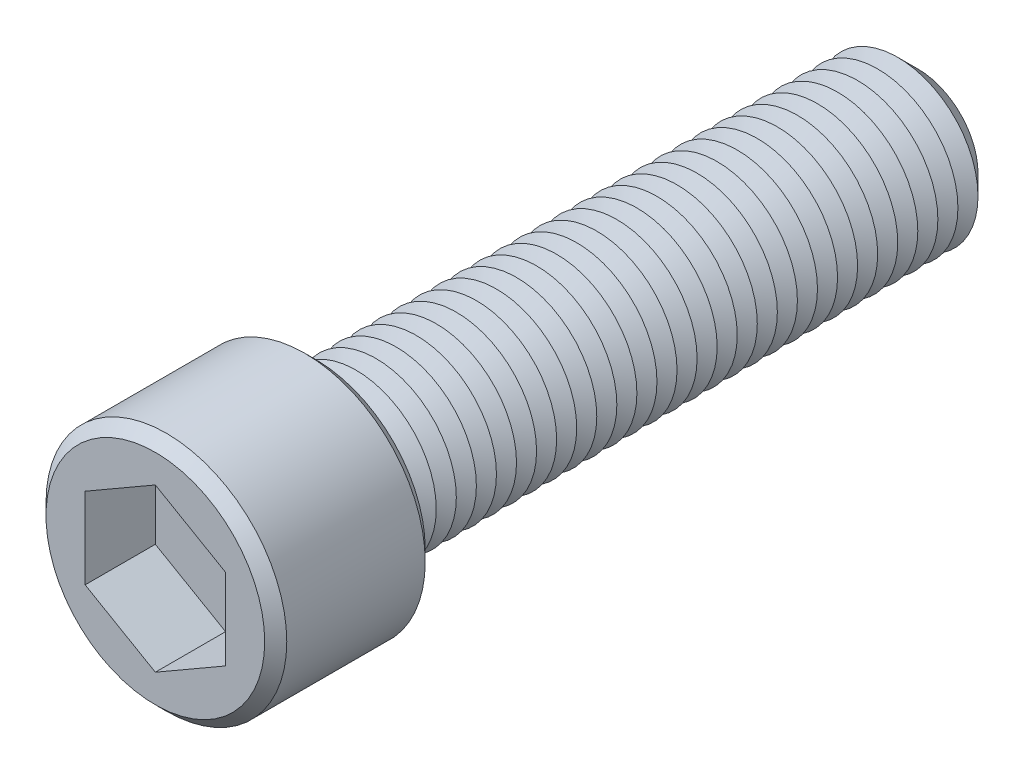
from build123d import *

# Parameters (mm, degrees)
SKETCH1_R           = 12
BOSS_EXTRUDE1_DEPTH = 16
SKETCH2_R           = 8
BOSS_EXTRUDE2_DEPTH = 60
CHAMFER1_SIZE       = 2
LPATTERN1_COUNT     = 29
LPATTERN1_PITCH     = 2
CUT_EXTRUDE1_DEPTH  = 7
SKETCH6_R           = 0.9
CUT_EXTRUDE2_DEPTH  = 69
CHAMFER2_SIZE       = 1.1


with BuildPart() as part:
    # Sketch1 → Boss-Extrude1 (new body)
    with BuildSketch(Plane.XY):
        Circle(SKETCH1_R)
    extrude(amount=BOSS_EXTRUDE1_DEPTH)

    # Sketch2 → Boss-Extrude2 (add)
    with BuildSketch(Plane(origin=(0, 0, 0), x_dir=(-1, 0, 0), z_dir=(0, 0, -1))):
        Circle(SKETCH2_R)
    extrude(amount=BOSS_EXTRUDE2_DEPTH)

    # Chamfer1
    chamfer1_edges = [part.edges().sort_by_distance(p)[0] for p in [
        (8, 0, -60),
    ]]
    chamfer(chamfer1_edges, length=CHAMFER1_SIZE)

    # Sketch4 → Cut-Revolve1 (revolve, cut)
    with BuildSketch(Plane(origin=(0, 0, 0), x_dir=(0, 0, -1), z_dir=(1, 0, 0)), mode=Mode.PRIVATE) as cut_revolve1_sk:
        Polygon((0, 8), (1, 6.267949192), (2, 8), align=None)
    cut_revolve1 = revolve(cut_revolve1_sk.sketch.rotate(Axis((0, 0, 2.512122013), (0, 0, -1)), 90), axis=Axis((0, 0, 2.512122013), (0, 0, -1)), mode=Mode.SUBTRACT)

    # LPattern1: Cut-Revolve1 ×29
    with Locations(*[(0, 0, -i * LPATTERN1_PITCH) for i in range(1, LPATTERN1_COUNT)]):
        add(cut_revolve1, mode=Mode.SUBTRACT)

    # Sketch5 → Cut-Extrude1 (cut)
    with BuildSketch(Plane.XY.offset(16)):
        Polygon((0, 8.082903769), (-7, 4.041451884), (-7, -4.041451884), (0, -8.082903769), (7, -4.041451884), (7, 4.041451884), align=None)
    extrude(amount=-CUT_EXTRUDE1_DEPTH, mode=Mode.SUBTRACT)

    # Sketch6 → Cut-Extrude2 (cut)
    with BuildSketch(Plane.XY.offset(9)):
        Circle(SKETCH6_R)
    extrude(amount=-CUT_EXTRUDE2_DEPTH, mode=Mode.SUBTRACT)

    # Chamfer2
    chamfer2_edges = [part.edges().sort_by_distance(p)[0] for p in [
        (-12, 0, 0),
        (-12, 0, 16),
    ]]
    chamfer(chamfer2_edges, length=CHAMFER2_SIZE)


solid = part.part
